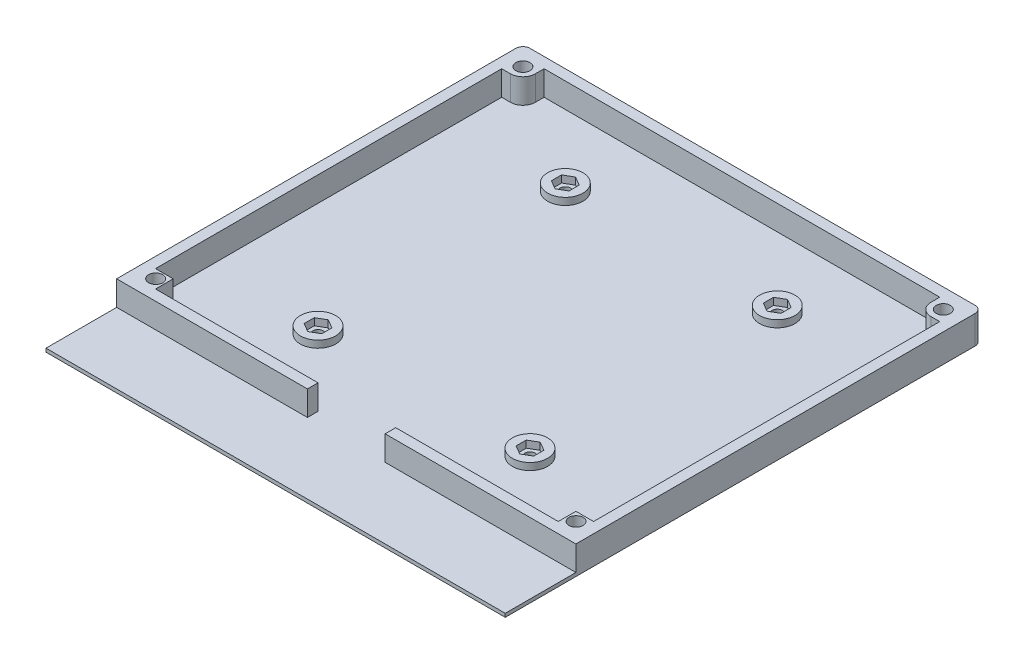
from build123d import *

# Parameters (mm, degrees)
BOSS_EXTRUDE1_DEPTH     = 1
BOSS_EXTRUDE2_START     = 7
BOSS_EXTRUDE2_DEPTH     = 7
SKETCH1_4_R             = 5
BOSS_EXTRUDE3_DEPTH     = 2
CUT_EXTRUDE1_DEPTH      = 95.049189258
CUT_EXTRUDE1_DEPTH_BACK = 95.049189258
SKETCH2_R               = 2
SKETCH2_R_2             = 1.5


with BuildPart() as part:
    # Sketch1 → Boss-Extrude1 (new body)
    with BuildSketch(Plane(origin=(0, 0, 0), x_dir=(1, 0, 0), z_dir=(0, 1, 0))):
        with BuildLine():
            Line((-65, -67.5), (65, -67.5))
            Line((65, -67.5), (65, 65.5))
            ThreePointArc((65, 65.5), (64.414213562, 66.914213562), (63, 67.5))
            Line((63, 67.5), (-63, 67.5))
            ThreePointArc((-63, 67.5), (-64.414213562, 66.914213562), (-65, 65.5))
            Line((-65, 65.5), (-65, -67.5))
        make_face()
    extrude(amount=-BOSS_EXTRUDE1_DEPTH)

    # Sketch1_3 → Boss-Extrude2 (add)
    with BuildSketch(Plane(origin=(0, 0, 0), x_dir=(1, 0, 0), z_dir=(0, 1, 0)).offset(BOSS_EXTRUDE2_START)):
        with BuildLine():
            Line((11, -47.5), (65, -47.5))
            Line((65, -47.5), (65, 65.5))
            ThreePointArc((65, 65.5), (64.414213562, 66.914213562), (63, 67.5))
            Line((63, 67.5), (-63, 67.5))
            ThreePointArc((-63, 67.5), (-64.414213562, 66.914213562), (-65, 65.5))
            Line((-65, 65.5), (-65, -47.5))
            Line((-65, -47.5), (-11, -47.5))
            Line((-11, -47.5), (-11, -44.5))
            Line((-11, -44.5), (-57, -44.5))
            Line((-57, -44.5), (-57, -39.5))
            Line((-57, -39.5), (-62, -39.5))
            Line((-62, -39.5), (-62, 58.5))
            Line((-62, 58.5), (-59.5, 58.5))
            ThreePointArc((-59.5, 58.5), (-57.025126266, 59.525126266), (-56, 62))
            Line((-56, 62), (-56, 64.5))
            Line((-56, 64.5), (56, 64.5))
            Line((56, 64.5), (56, 62))
            ThreePointArc((56, 62), (57.025126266, 59.525126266), (59.5, 58.5))
            Line((59.5, 58.5), (62, 58.5))
            Line((62, 58.5), (62, -39.5))
            Line((62, -39.5), (57, -39.5))
            Line((57, -39.5), (57, -44.5))
            Line((57, -44.5), (11, -44.5))
            Line((11, -44.5), (11, -47.5))
        make_face()
    extrude(amount=-BOSS_EXTRUDE2_DEPTH)

    # Sketch1_4 → Boss-Extrude3 (add)
    # profile 1 of 4: a face of its own
    with BuildSketch(Plane(origin=(0, 0, 0), x_dir=(1, 0, 0), z_dir=(0, 1, 0))):
        with Locations(Location((-30, 44.5, 0), (0, 0, 270))):
            Circle(SKETCH1_4_R)
        Polygon((-32.5, 43.056624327), (-30, 41.613248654), (-27.5, 43.056624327), (-27.5, 45.943375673), (-30, 47.386751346), (-32.5, 45.943375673), align=None, mode=Mode.SUBTRACT)
    # profile 2 of 4: a face of its own
    with BuildSketch(Plane(origin=(0, 0, 0), x_dir=(1, 0, 0), z_dir=(0, 1, 0))):
        with Locations(Location((30, 44.5, 0), (0, 0, 270))):
            Circle(SKETCH1_4_R)
        Polygon((27.5, 43.056624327), (30, 41.613248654), (32.5, 43.056624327), (32.5, 45.943375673), (30, 47.386751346), (27.5, 45.943375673), align=None, mode=Mode.SUBTRACT)
    # profile 3 of 4: a face of its own
    with BuildSketch(Plane(origin=(0, 0, 0), x_dir=(1, 0, 0), z_dir=(0, 1, 0))):
        with Locations(Location((-30, -25.5, 0), (0, 0, 270))):
            Circle(SKETCH1_4_R)
        Polygon((-32.5, -26.943375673), (-30, -28.386751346), (-27.5, -26.943375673), (-27.5, -24.056624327), (-30, -22.613248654), (-32.5, -24.056624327), align=None, mode=Mode.SUBTRACT)
    # profile 4 of 4: a face of its own
    with BuildSketch(Plane(origin=(0, 0, 0), x_dir=(1, 0, 0), z_dir=(0, 1, 0))):
        with Locations(Location((30, -25.5, 0), (0, 0, 270))):
            Circle(SKETCH1_4_R)
        Polygon((27.5, -26.943375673), (30, -28.386751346), (32.5, -26.943375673), (32.5, -24.056624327), (30, -22.613248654), (27.5, -24.056624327), align=None, mode=Mode.SUBTRACT)
    extrude(amount=BOSS_EXTRUDE3_DEPTH)

    # Sketch2 → Cut-Extrude1 (cut, two sides: drawn at the far end of the back side and taken through both)
    with BuildSketch(Plane(origin=(0, 7, 0), x_dir=(1, 0, 0), z_dir=(0, 1, 0)).offset(-CUT_EXTRUDE1_DEPTH_BACK)):
        with Locations(Location((-59.5, 62, 0), (0, 0, 270))):
            Circle(SKETCH2_R)
        with Locations(Location((59.5, 62, 0), (0, 0, 270))):
            Circle(SKETCH2_R)
        with Locations(Location((-59.5, -41.96254233, 0), (0, 0, 270))):
            Circle(SKETCH2_R)
        with Locations(Location((59.5, -41.96254233, 0), (0, 0, 270))):
            Circle(SKETCH2_R)
        with Locations(Location((-30, 44.5, 0), (0, 0, 270))):
            Circle(SKETCH2_R_2)
        with Locations(Location((30, 44.5, 0), (0, 0, 270))):
            Circle(SKETCH2_R_2)
        with Locations(Location((-30, -25.5, 0), (0, 0, 270))):
            Circle(SKETCH2_R_2)
        with Locations(Location((30, -25.5, 0), (0, 0, 270))):
            Circle(SKETCH2_R_2)
    extrude(amount=CUT_EXTRUDE1_DEPTH + CUT_EXTRUDE1_DEPTH_BACK, mode=Mode.SUBTRACT)


solid = part.part
